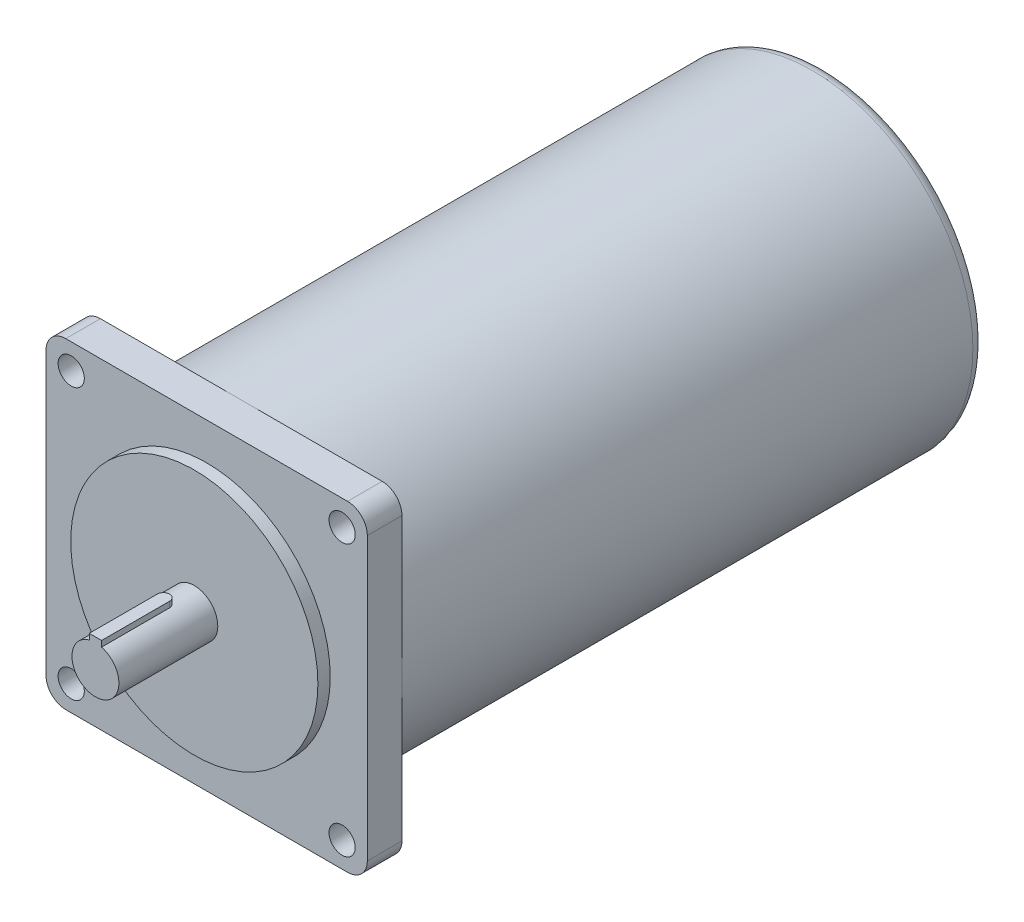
ISO-10303-21;
HEADER;
FILE_DESCRIPTION(('STEP AP214'),'2;1');
FILE_NAME('part.step','',(''),(''),'','','');
FILE_SCHEMA(('AUTOMOTIVE_DESIGN { 1 0 10303 214 1 1 1 1 }'));
ENDSEC;
DATA;
#1=APPLICATION_CONTEXT('core data for automotive mechanical design processes');
#2=APPLICATION_PROTOCOL_DEFINITION('international standard','automotive_design',2000,#1);
#3=PRODUCT_CONTEXT('',#1,'mechanical');
#4=PRODUCT('Part','Part','',(#3));
#5=PRODUCT_RELATED_PRODUCT_CATEGORY('part','',(#4));
#6=PRODUCT_DEFINITION_FORMATION('','',#4);
#7=PRODUCT_DEFINITION_CONTEXT('part definition',#1,'design');
#8=PRODUCT_DEFINITION('design','',#6,#7);
#9=PRODUCT_DEFINITION_SHAPE('','',#8);
#10=(LENGTH_UNIT() NAMED_UNIT(*) SI_UNIT(.MILLI.,.METRE.));
#11=(NAMED_UNIT(*) PLANE_ANGLE_UNIT() SI_UNIT($,.RADIAN.));
#12=(NAMED_UNIT(*) SI_UNIT($,.STERADIAN.) SOLID_ANGLE_UNIT());
#13=UNCERTAINTY_MEASURE_WITH_UNIT(LENGTH_MEASURE(1.E-05),#10,'distance_accuracy_value','');
#14=(GEOMETRIC_REPRESENTATION_CONTEXT(3) GLOBAL_UNCERTAINTY_ASSIGNED_CONTEXT((#13)) GLOBAL_UNIT_ASSIGNED_CONTEXT((#10,
#11,#12)) REPRESENTATION_CONTEXT('',''));
#15=CARTESIAN_POINT('',(0.,0.,0.));
#16=DIRECTION('',(0.,0.,1.));
#17=DIRECTION('',(1.,0.,0.));
#18=AXIS2_PLACEMENT_3D('',#15,#16,#17);
#19=CARTESIAN_POINT('',(57.,-57.,-19.));
#20=DIRECTION('',(0.,0.,1.));
#21=DIRECTION('',(1.,0.,0.));
#22=AXIS2_PLACEMENT_3D('',#19,#20,#21);
#23=PLANE('',#22);
#24=CARTESIAN_POINT('',(-54.8,54.8,-19.));
#25=DIRECTION('',(0.,0.,-1.));
#26=DIRECTION('',(-1.,0.,0.));
#27=AXIS2_PLACEMENT_3D('',#24,#25,#26);
#28=CIRCLE('',#27,5.3);
#29=CARTESIAN_POINT('',(-60.1,54.8,-19.));
#30=VERTEX_POINT('',#29);
#31=EDGE_CURVE('E184',#30,#30,#28,.T.);
#32=ORIENTED_EDGE('',*,*,#31,.F.);
#33=EDGE_LOOP('',(#32));
#34=FACE_BOUND('',#33,.T.);
#35=CARTESIAN_POINT('',(0.,0.,-19.));
#36=DIRECTION('',(0.,0.,-1.));
#37=DIRECTION('',(-1.,0.,0.));
#38=AXIS2_PLACEMENT_3D('',#35,#36,#37);
#39=CIRCLE('',#38,65.);
#40=CARTESIAN_POINT('',(-65.,0.,-19.));
#41=VERTEX_POINT('',#40);
#42=CARTESIAN_POINT('',(0.,65.,-19.));
#43=VERTEX_POINT('',#42);
#44=EDGE_CURVE('E160',#41,#43,#39,.T.);
#45=ORIENTED_EDGE('',*,*,#44,.F.);
#46=DIRECTION('',(0.,1.,0.));
#47=VECTOR('',#46,1.);
#48=CARTESIAN_POINT('',(-65.,56.9999999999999,-19.));
#49=LINE('',#48,#47);
#50=CARTESIAN_POINT('',(-65.,56.9999999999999,-19.));
#51=VERTEX_POINT('',#50);
#52=EDGE_CURVE('E149',#41,#51,#49,.T.);
#53=ORIENTED_EDGE('',*,*,#52,.T.);
#54=CARTESIAN_POINT('',(-57.,57.,-19.));
#55=DIRECTION('',(0.,0.,-1.));
#56=DIRECTION('',(1.,0.,0.));
#57=AXIS2_PLACEMENT_3D('',#54,#55,#56);
#58=CIRCLE('',#57,8.);
#59=CARTESIAN_POINT('',(-56.9999999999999,65.,-19.));
#60=VERTEX_POINT('',#59);
#61=EDGE_CURVE('E148',#51,#60,#58,.T.);
#62=ORIENTED_EDGE('',*,*,#61,.T.);
#63=DIRECTION('',(1.,0.,0.));
#64=VECTOR('',#63,1.);
#65=CARTESIAN_POINT('',(0.,65.,-19.));
#66=LINE('',#65,#64);
#67=EDGE_CURVE('E162',#60,#43,#66,.T.);
#68=ORIENTED_EDGE('',*,*,#67,.T.);
#69=EDGE_LOOP('',(#45,#53,#62,#68));
#70=FACE_BOUND('',#69,.T.);
#71=ADVANCED_FACE('F35',(#34,#70),#23,.F.);
#72=CARTESIAN_POINT('',(54.8,54.8,-19.));
#73=DIRECTION('',(0.,0.,-1.));
#74=DIRECTION('',(-1.,0.,0.));
#75=AXIS2_PLACEMENT_3D('',#72,#73,#74);
#76=CIRCLE('',#75,5.3);
#77=CARTESIAN_POINT('',(49.5,54.8,-19.));
#78=VERTEX_POINT('',#77);
#79=EDGE_CURVE('E190',#78,#78,#76,.T.);
#80=ORIENTED_EDGE('',*,*,#79,.F.);
#81=EDGE_LOOP('',(#80));
#82=FACE_BOUND('',#81,.T.);
#83=CARTESIAN_POINT('',(65.,0.,-19.));
#84=VERTEX_POINT('',#83);
#85=EDGE_CURVE('E58',#43,#84,#39,.T.);
#86=ORIENTED_EDGE('',*,*,#85,.F.);
#87=CARTESIAN_POINT('',(56.9999999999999,65.,-19.));
#88=VERTEX_POINT('',#87);
#89=EDGE_CURVE('E205',#43,#88,#66,.T.);
#90=ORIENTED_EDGE('',*,*,#89,.T.);
#91=CARTESIAN_POINT('',(57.,57.,-19.));
#92=DIRECTION('',(0.,0.,-1.));
#93=DIRECTION('',(1.,0.,0.));
#94=AXIS2_PLACEMENT_3D('',#91,#92,#93);
#95=CIRCLE('',#94,8.);
#96=CARTESIAN_POINT('',(65.,56.9999999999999,-19.));
#97=VERTEX_POINT('',#96);
#98=EDGE_CURVE('E207',#88,#97,#95,.T.);
#99=ORIENTED_EDGE('',*,*,#98,.T.);
#100=DIRECTION('',(0.,-1.,0.));
#101=VECTOR('',#100,1.);
#102=CARTESIAN_POINT('',(65.,-57.,-19.));
#103=LINE('',#102,#101);
#104=EDGE_CURVE('E210',#97,#84,#103,.T.);
#105=ORIENTED_EDGE('',*,*,#104,.T.);
#106=EDGE_LOOP('',(#86,#90,#99,#105));
#107=FACE_BOUND('',#106,.T.);
#108=ADVANCED_FACE('F311',(#82,#107),#23,.F.);
#109=CARTESIAN_POINT('',(54.8,-54.8,-19.));
#110=DIRECTION('',(0.,0.,-1.));
#111=DIRECTION('',(-1.,0.,0.));
#112=AXIS2_PLACEMENT_3D('',#109,#110,#111);
#113=CIRCLE('',#112,5.3);
#114=CARTESIAN_POINT('',(49.5,-54.8,-19.));
#115=VERTEX_POINT('',#114);
#116=EDGE_CURVE('E172',#115,#115,#113,.T.);
#117=ORIENTED_EDGE('',*,*,#116,.F.);
#118=EDGE_LOOP('',(#117));
#119=FACE_BOUND('',#118,.T.);
#120=CARTESIAN_POINT('',(0.,-65.,-19.));
#121=VERTEX_POINT('',#120);
#122=EDGE_CURVE('E50',#84,#121,#39,.T.);
#123=ORIENTED_EDGE('',*,*,#122,.F.);
#124=CARTESIAN_POINT('',(65.,-57.,-19.));
#125=VERTEX_POINT('',#124);
#126=EDGE_CURVE('E209',#84,#125,#103,.T.);
#127=ORIENTED_EDGE('',*,*,#126,.T.);
#128=CARTESIAN_POINT('',(57.,-57.,-19.));
#129=DIRECTION('',(0.,0.,-1.));
#130=DIRECTION('',(1.,0.,0.));
#131=AXIS2_PLACEMENT_3D('',#128,#129,#130);
#132=CIRCLE('',#131,8.);
#133=CARTESIAN_POINT('',(56.9999999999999,-65.,-19.));
#134=VERTEX_POINT('',#133);
#135=EDGE_CURVE('E196',#125,#134,#132,.T.);
#136=ORIENTED_EDGE('',*,*,#135,.T.);
#137=DIRECTION('',(-1.,0.,0.));
#138=VECTOR('',#137,1.);
#139=CARTESIAN_POINT('',(-57.,-65.,-19.));
#140=LINE('',#139,#138);
#141=EDGE_CURVE('E201',#134,#121,#140,.T.);
#142=ORIENTED_EDGE('',*,*,#141,.T.);
#143=EDGE_LOOP('',(#123,#127,#136,#142));
#144=FACE_BOUND('',#143,.T.);
#145=ADVANCED_FACE('F317',(#119,#144),#23,.F.);
#146=CARTESIAN_POINT('',(-54.8,-54.8,-19.));
#147=DIRECTION('',(0.,0.,-1.));
#148=DIRECTION('',(-1.,0.,0.));
#149=AXIS2_PLACEMENT_3D('',#146,#147,#148);
#150=CIRCLE('',#149,5.3);
#151=CARTESIAN_POINT('',(-60.1,-54.8,-19.));
#152=VERTEX_POINT('',#151);
#153=EDGE_CURVE('E178',#152,#152,#150,.T.);
#154=ORIENTED_EDGE('',*,*,#153,.F.);
#155=EDGE_LOOP('',(#154));
#156=FACE_BOUND('',#155,.T.);
#157=EDGE_CURVE('E141',#121,#41,#39,.T.);
#158=ORIENTED_EDGE('',*,*,#157,.F.);
#159=CARTESIAN_POINT('',(-57.,-65.,-19.));
#160=VERTEX_POINT('',#159);
#161=EDGE_CURVE('E199',#121,#160,#140,.T.);
#162=ORIENTED_EDGE('',*,*,#161,.T.);
#163=CARTESIAN_POINT('',(-57.,-57.,-19.));
#164=DIRECTION('',(0.,0.,-1.));
#165=DIRECTION('',(1.,0.,0.));
#166=AXIS2_PLACEMENT_3D('',#163,#164,#165);
#167=CIRCLE('',#166,8.);
#168=CARTESIAN_POINT('',(-65.,-56.9999999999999,-19.));
#169=VERTEX_POINT('',#168);
#170=EDGE_CURVE('E144',#160,#169,#167,.T.);
#171=ORIENTED_EDGE('',*,*,#170,.T.);
#172=EDGE_CURVE('E137',#169,#41,#49,.T.);
#173=ORIENTED_EDGE('',*,*,#172,.T.);
#174=EDGE_LOOP('',(#158,#162,#171,#173));
#175=FACE_BOUND('',#174,.T.);
#176=ADVANCED_FACE('F139',(#156,#175),#23,.F.);
#177=CARTESIAN_POINT('',(0.,0.,40.));
#178=DIRECTION('',(0.,0.,-1.));
#179=DIRECTION('',(-1.,0.,0.));
#180=AXIS2_PLACEMENT_3D('',#177,#178,#179);
#181=CYLINDRICAL_SURFACE('',#180,9.5);
#182=CARTESIAN_POINT('',(0.,0.,0.));
#183=DIRECTION('',(0.,0.,1.));
#184=DIRECTION('',(1.,0.,0.));
#185=AXIS2_PLACEMENT_3D('',#182,#183,#184);
#186=CIRCLE('',#185,9.5);
#187=CARTESIAN_POINT('',(9.5,0.,0.));
#188=VERTEX_POINT('',#187);
#189=EDGE_CURVE('E279',#188,#188,#186,.T.);
#190=ORIENTED_EDGE('',*,*,#189,.T.);
#191=EDGE_LOOP('',(#190));
#192=FACE_BOUND('',#191,.T.);
#193=DIRECTION('',(0.,0.,-1.));
#194=VECTOR('',#193,1.);
#195=CARTESIAN_POINT('',(-2.5,9.16515138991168,40.));
#196=LINE('',#195,#194);
#197=CARTESIAN_POINT('',(-2.5,9.16515138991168,12.5));
#198=VERTEX_POINT('',#197);
#199=CARTESIAN_POINT('',(-2.5,9.16515138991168,40.));
#200=VERTEX_POINT('',#199);
#201=EDGE_CURVE('E276',#198,#200,#196,.F.);
#202=ORIENTED_EDGE('',*,*,#201,.F.);
#203=CARTESIAN_POINT('',(0.,9.5,10.));
#204=CARTESIAN_POINT('',(-0.137884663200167,9.4999978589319,10.0000034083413));
#205=CARTESIAN_POINT('',(-0.275806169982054,9.49696845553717,10.0114455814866));
#206=CARTESIAN_POINT('',(-0.547680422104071,9.48517762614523,10.0568336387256));
#207=CARTESIAN_POINT('',(-0.681631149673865,9.47641333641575,10.0907907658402));
#208=CARTESIAN_POINT('',(-0.941599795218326,9.45412076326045,10.1800315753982));
#209=CARTESIAN_POINT('',(-1.06762755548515,9.44059853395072,10.2352881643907));
#210=CARTESIAN_POINT('',(-1.30862652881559,9.41022151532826,10.3654600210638));
#211=CARTESIAN_POINT('',(-1.42359708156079,9.39336652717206,10.4403764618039));
#212=CARTESIAN_POINT('',(-1.64181993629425,9.35771941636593,10.6095316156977));
#213=CARTESIAN_POINT('',(-1.74478634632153,9.33889486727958,10.7041323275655));
#214=CARTESIAN_POINT('',(-1.93359084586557,9.30164002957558,10.9091965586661));
#215=CARTESIAN_POINT('',(-2.01942679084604,9.28320979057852,11.0196620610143));
#216=CARTESIAN_POINT('',(-2.17291708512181,9.24849966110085,11.2555887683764));
#217=CARTESIAN_POINT('',(-2.24024449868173,9.23226073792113,11.3812692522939));
#218=CARTESIAN_POINT('',(-2.35270147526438,9.20424780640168,11.6426621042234));
#219=CARTESIAN_POINT('',(-2.39783501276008,9.19247299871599,11.7783726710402));
#220=CARTESIAN_POINT('',(-2.46363395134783,9.17505594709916,12.0528119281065));
#221=CARTESIAN_POINT('',(-2.48481677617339,9.16928424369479,12.1914081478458));
#222=CARTESIAN_POINT('',(-2.50372582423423,9.16413995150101,12.470298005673));
#223=CARTESIAN_POINT('',(-2.50145630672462,9.16476620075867,12.6105913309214));
#224=CARTESIAN_POINT('',(-2.47393631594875,9.1722310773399,12.8848702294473));
#225=CARTESIAN_POINT('',(-2.44930986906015,9.1789010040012,13.0189237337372));
#226=CARTESIAN_POINT('',(-2.37877367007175,9.19743185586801,13.2809260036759));
#227=CARTESIAN_POINT('',(-2.33286225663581,9.2092931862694,13.4088742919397));
#228=CARTESIAN_POINT('',(-2.22054589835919,9.23702010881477,13.6566707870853));
#229=CARTESIAN_POINT('',(-2.1539205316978,9.25292841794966,13.7764141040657));
#230=CARTESIAN_POINT('',(-2.00222137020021,9.28693362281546,14.0032413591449));
#231=CARTESIAN_POINT('',(-1.91714402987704,9.30503093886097,14.1103228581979));
#232=CARTESIAN_POINT('',(-1.72775627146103,9.3420790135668,14.3123544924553));
#233=CARTESIAN_POINT('',(-1.62292126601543,9.36103863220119,14.4068119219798));
#234=CARTESIAN_POINT('',(-1.3986680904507,9.39715951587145,14.5769046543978));
#235=CARTESIAN_POINT('',(-1.27924937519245,9.41432071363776,14.6525392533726));
#236=CARTESIAN_POINT('',(-1.02846858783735,9.44501219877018,14.7830484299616));
#237=CARTESIAN_POINT('',(-0.897059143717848,9.45852716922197,14.8378358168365));
#238=CARTESIAN_POINT('',(-0.626458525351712,9.48029259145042,14.924400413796));
#239=CARTESIAN_POINT('',(-0.487269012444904,9.48854416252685,14.9561825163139));
#240=CARTESIAN_POINT('',(-0.209265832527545,9.49868456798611,14.9950653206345));
#241=CARTESIAN_POINT('',(-0.070552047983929,9.50074610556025,15.0028361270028));
#242=CARTESIAN_POINT('',(0.206196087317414,9.49876969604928,14.9953236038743));
#243=CARTESIAN_POINT('',(0.344230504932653,9.49473236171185,14.9800425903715));
#244=CARTESIAN_POINT('',(0.613323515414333,9.48112321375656,14.9274104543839));
#245=CARTESIAN_POINT('',(0.744460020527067,9.47164474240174,14.8904313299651));
#246=CARTESIAN_POINT('',(0.998656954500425,9.44822690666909,14.7958831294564));
#247=CARTESIAN_POINT('',(1.12171651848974,9.43428706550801,14.7383118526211));
#248=CARTESIAN_POINT('',(1.35888360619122,9.40308612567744,14.6029586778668));
#249=CARTESIAN_POINT('',(1.47277384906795,9.38576639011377,14.5248099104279));
#250=CARTESIAN_POINT('',(1.68605972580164,9.34980860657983,14.3509829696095));
#251=CARTESIAN_POINT('',(1.78545256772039,9.33117030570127,14.2553014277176));
#252=CARTESIAN_POINT('',(1.96973268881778,9.29404354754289,14.0460009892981));
#253=CARTESIAN_POINT('',(2.05414772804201,9.27557319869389,13.9319623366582));
#254=CARTESIAN_POINT('',(2.20265077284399,9.24143699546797,13.690949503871));
#255=CARTESIAN_POINT('',(2.26673964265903,9.22577102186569,13.5639758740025));
#256=CARTESIAN_POINT('',(2.37228864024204,9.1991961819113,13.3013437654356));
#257=CARTESIAN_POINT('',(2.41388084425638,9.18825962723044,13.165741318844));
#258=CARTESIAN_POINT('',(2.47357685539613,9.17237100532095,12.8891317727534));
#259=CARTESIAN_POINT('',(2.49168647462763,9.16741745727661,12.7481260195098));
#260=CARTESIAN_POINT('',(2.5035754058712,9.16417710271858,12.4695408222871));
#261=CARTESIAN_POINT('',(2.49811278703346,9.16568256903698,12.3319956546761));
#262=CARTESIAN_POINT('',(2.46476570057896,9.17470557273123,12.0598619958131));
#263=CARTESIAN_POINT('',(2.43688178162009,9.18222296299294,11.9252734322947));
#264=CARTESIAN_POINT('',(2.35991776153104,9.20230081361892,11.6637995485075));
#265=CARTESIAN_POINT('',(2.31099432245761,9.21482395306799,11.5368650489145));
#266=CARTESIAN_POINT('',(2.19346205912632,9.2435040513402,11.2929108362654));
#267=CARTESIAN_POINT('',(2.12485022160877,9.25966156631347,11.1758926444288));
#268=CARTESIAN_POINT('',(1.96757430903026,9.29436941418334,10.9514645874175));
#269=CARTESIAN_POINT('',(1.87839103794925,9.31297513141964,10.8444270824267));
#270=CARTESIAN_POINT('',(1.68349652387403,9.35016921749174,10.6465905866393));
#271=CARTESIAN_POINT('',(1.57778128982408,9.36875758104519,10.5557955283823));
#272=CARTESIAN_POINT('',(1.35018708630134,9.40428175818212,10.3911797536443));
#273=CARTESIAN_POINT('',(1.22801920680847,9.42117547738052,10.3177486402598));
#274=CARTESIAN_POINT('',(0.972633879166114,9.45095016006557,10.1925825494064));
#275=CARTESIAN_POINT('',(0.839423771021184,9.46383376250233,10.1408332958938));
#276=CARTESIAN_POINT('',(0.588875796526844,9.48241870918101,10.0674519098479));
#277=CARTESIAN_POINT('',(0.472643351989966,9.4889642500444,10.0422152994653));
#278=CARTESIAN_POINT('',(0.237616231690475,9.49775561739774,10.0084886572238));
#279=CARTESIAN_POINT('',(0.118821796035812,9.50000184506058,9.99999706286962));
#280=CARTESIAN_POINT('',(0.,9.5,10.));
#281=B_SPLINE_CURVE_WITH_KNOTS('',3,(#203,#204,#205,#206,#207,#208,#209,#210,#211,#212,#213,
#214,#215,#216,#217,#218,#219,#220,#221,#222,#223,#224,#225,#226,#227,#228,#229,#230,#231,#232,
#233,#234,#235,#236,#237,#238,#239,#240,#241,#242,#243,#244,#245,#246,#247,#248,#249,#250,#251,
#252,#253,#254,#255,#256,#257,#258,#259,#260,#261,#262,#263,#264,#265,#266,#267,#268,#269,#270,
#271,#272,#273,#274,#275,#276,#277,#278,#279,#280),.UNSPECIFIED.,.T.,.F.,(4,2,2,2,2,2,2,2,2,2,2,
2,2,2,2,2,2,2,2,2,2,2,2,2,2,2,2,2,2,2,2,2,2,2,2,2,2,2,4),(0.,0.41321830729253,0.826643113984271,
1.23954376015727,1.65246904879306,2.07379267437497,2.49516901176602,2.92356960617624,
3.35189345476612,3.77077570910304,4.18958189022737,4.59704611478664,5.00454214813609,
5.41653210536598,5.82860129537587,6.25374475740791,6.67890411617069,7.10582259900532,
7.53265026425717,7.9474532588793,8.36221458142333,8.77006471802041,9.17795845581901,
9.59368485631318,10.0094912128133,10.4366941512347,10.8638789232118,11.2885277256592,
11.7130714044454,12.1240655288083,12.5350495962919,12.9430250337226,13.3510629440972,
13.7708169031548,14.1906723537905,14.6192052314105,15.0474555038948,15.4035786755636,
15.7596686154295),.UNSPECIFIED.);
#282=CARTESIAN_POINT('',(2.5,9.16515138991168,12.5));
#283=VERTEX_POINT('',#282);
#284=EDGE_CURVE('E167',#283,#198,#281,.T.);
#285=ORIENTED_EDGE('',*,*,#284,.F.);
#286=DIRECTION('',(0.,0.,-1.));
#287=VECTOR('',#286,1.);
#288=CARTESIAN_POINT('',(2.5,9.16515138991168,40.));
#289=LINE('',#288,#287);
#290=CARTESIAN_POINT('',(2.5,9.16515138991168,40.));
#291=VERTEX_POINT('',#290);
#292=EDGE_CURVE('E273',#291,#283,#289,.T.);
#293=ORIENTED_EDGE('',*,*,#292,.F.);
#294=CARTESIAN_POINT('',(0.,0.,40.));
#295=DIRECTION('',(0.,0.,1.));
#296=DIRECTION('',(1.,0.,0.));
#297=AXIS2_PLACEMENT_3D('',#294,#295,#296);
#298=CIRCLE('',#297,9.5);
#299=EDGE_CURVE('E280',#200,#291,#298,.T.);
#300=ORIENTED_EDGE('',*,*,#299,.F.);
#301=EDGE_LOOP('',(#202,#285,#293,#300));
#302=FACE_BOUND('',#301,.T.);
#303=ADVANCED_FACE('F290',(#192,#302),#181,.T.);
#304=CARTESIAN_POINT('',(0.,0.,0.));
#305=DIRECTION('',(0.,0.,1.));
#306=DIRECTION('',(1.,0.,0.));
#307=AXIS2_PLACEMENT_3D('',#304,#305,#306);
#308=PLANE('',#307);
#309=CARTESIAN_POINT('',(0.,0.,0.));
#310=DIRECTION('',(0.,0.,1.));
#311=DIRECTION('',(1.,0.,0.));
#312=AXIS2_PLACEMENT_3D('',#309,#310,#311);
#313=CIRCLE('',#312,50.);
#314=CARTESIAN_POINT('',(50.,0.,0.));
#315=VERTEX_POINT('',#314);
#316=EDGE_CURVE('E169',#315,#315,#313,.T.);
#317=ORIENTED_EDGE('',*,*,#316,.T.);
#318=EDGE_LOOP('',(#317));
#319=FACE_BOUND('',#318,.T.);
#320=ORIENTED_EDGE('',*,*,#189,.F.);
#321=EDGE_LOOP('',(#320));
#322=FACE_BOUND('',#321,.T.);
#323=ADVANCED_FACE('F308',(#319,#322),#308,.T.);
#324=CARTESIAN_POINT('',(0.,0.,-5.));
#325=DIRECTION('',(0.,0.,1.));
#326=DIRECTION('',(1.,0.,0.));
#327=AXIS2_PLACEMENT_3D('',#324,#325,#326);
#328=CYLINDRICAL_SURFACE('',#327,50.);
#329=CARTESIAN_POINT('',(0.,0.,-5.));
#330=DIRECTION('',(0.,0.,1.));
#331=DIRECTION('',(1.,0.,0.));
#332=AXIS2_PLACEMENT_3D('',#329,#330,#331);
#333=CIRCLE('',#332,50.);
#334=CARTESIAN_POINT('',(50.,0.,-5.));
#335=VERTEX_POINT('',#334);
#336=EDGE_CURVE('E249',#335,#335,#333,.F.);
#337=ORIENTED_EDGE('',*,*,#336,.F.);
#338=EDGE_LOOP('',(#337));
#339=FACE_BOUND('',#338,.T.);
#340=ORIENTED_EDGE('',*,*,#316,.F.);
#341=EDGE_LOOP('',(#340));
#342=FACE_BOUND('',#341,.T.);
#343=ADVANCED_FACE('F303',(#339,#342),#328,.T.);
#344=CARTESIAN_POINT('',(0.,0.,40.));
#345=DIRECTION('',(0.,0.,1.));
#346=DIRECTION('',(1.,0.,0.));
#347=AXIS2_PLACEMENT_3D('',#344,#345,#346);
#348=PLANE('',#347);
#349=ORIENTED_EDGE('',*,*,#299,.T.);
#350=DIRECTION('',(0.,-1.,0.));
#351=VECTOR('',#350,1.);
#352=CARTESIAN_POINT('',(2.5,11.5,40.));
#353=LINE('',#352,#351);
#354=CARTESIAN_POINT('',(2.5,11.5,40.));
#355=VERTEX_POINT('',#354);
#356=EDGE_CURVE('E264',#355,#291,#353,.T.);
#357=ORIENTED_EDGE('',*,*,#356,.F.);
#358=DIRECTION('',(1.,0.,0.));
#359=VECTOR('',#358,1.);
#360=CARTESIAN_POINT('',(-2.5,11.5,40.));
#361=LINE('',#360,#359);
#362=CARTESIAN_POINT('',(-2.5,11.5,40.));
#363=VERTEX_POINT('',#362);
#364=EDGE_CURVE('E257',#363,#355,#361,.T.);
#365=ORIENTED_EDGE('',*,*,#364,.F.);
#366=DIRECTION('',(0.,-1.,0.));
#367=VECTOR('',#366,1.);
#368=CARTESIAN_POINT('',(-2.5,11.5,40.));
#369=LINE('',#368,#367);
#370=EDGE_CURVE('E267',#363,#200,#369,.T.);
#371=ORIENTED_EDGE('',*,*,#370,.T.);
#372=EDGE_LOOP('',(#349,#357,#365,#371));
#373=FACE_BOUND('',#372,.T.);
#374=ADVANCED_FACE('F299',(#373),#348,.T.);
#375=CARTESIAN_POINT('',(0.,11.5,12.5));
#376=DIRECTION('',(0.,-1.,0.));
#377=DIRECTION('',(0.,0.,-1.));
#378=AXIS2_PLACEMENT_3D('',#375,#376,#377);
#379=CYLINDRICAL_SURFACE('',#378,2.5);
#380=DIRECTION('',(0.,-1.,0.));
#381=VECTOR('',#380,1.);
#382=CARTESIAN_POINT('',(2.5,11.5,12.5));
#383=LINE('',#382,#381);
#384=CARTESIAN_POINT('',(2.5,11.5,12.5));
#385=VERTEX_POINT('',#384);
#386=EDGE_CURVE('E261',#385,#283,#383,.T.);
#387=ORIENTED_EDGE('',*,*,#386,.T.);
#388=ORIENTED_EDGE('',*,*,#284,.T.);
#389=DIRECTION('',(0.,-1.,0.));
#390=VECTOR('',#389,1.);
#391=CARTESIAN_POINT('',(-2.5,11.5,12.5));
#392=LINE('',#391,#390);
#393=CARTESIAN_POINT('',(-2.5,11.5,12.5));
#394=VERTEX_POINT('',#393);
#395=EDGE_CURVE('E270',#394,#198,#392,.T.);
#396=ORIENTED_EDGE('',*,*,#395,.F.);
#397=CARTESIAN_POINT('',(0.,11.5,12.5));
#398=DIRECTION('',(0.,1.,0.));
#399=DIRECTION('',(0.,0.,1.));
#400=AXIS2_PLACEMENT_3D('',#397,#398,#399);
#401=CIRCLE('',#400,2.5);
#402=EDGE_CURVE('E252',#385,#394,#401,.T.);
#403=ORIENTED_EDGE('',*,*,#402,.F.);
#404=EDGE_LOOP('',(#387,#388,#396,#403));
#405=FACE_BOUND('',#404,.T.);
#406=ADVANCED_FACE('F294',(#405),#379,.T.);
#407=CARTESIAN_POINT('',(-2.5,11.5,12.5));
#408=DIRECTION('',(1.,0.,0.));
#409=DIRECTION('',(0.,0.,-1.));
#410=AXIS2_PLACEMENT_3D('',#407,#408,#409);
#411=PLANE('',#410);
#412=ORIENTED_EDGE('',*,*,#395,.T.);
#413=ORIENTED_EDGE('',*,*,#201,.T.);
#414=ORIENTED_EDGE('',*,*,#370,.F.);
#415=DIRECTION('',(0.,0.,1.));
#416=VECTOR('',#415,1.);
#417=CARTESIAN_POINT('',(-2.5,11.5,12.5));
#418=LINE('',#417,#416);
#419=EDGE_CURVE('E255',#394,#363,#418,.T.);
#420=ORIENTED_EDGE('',*,*,#419,.F.);
#421=EDGE_LOOP('',(#412,#413,#414,#420));
#422=FACE_BOUND('',#421,.T.);
#423=ADVANCED_FACE('F298',(#422),#411,.F.);
#424=CARTESIAN_POINT('',(2.5,11.5,40.));
#425=DIRECTION('',(-1.,0.,0.));
#426=DIRECTION('',(0.,0.,1.));
#427=AXIS2_PLACEMENT_3D('',#424,#425,#426);
#428=PLANE('',#427);
#429=ORIENTED_EDGE('',*,*,#356,.T.);
#430=ORIENTED_EDGE('',*,*,#292,.T.);
#431=ORIENTED_EDGE('',*,*,#386,.F.);
#432=DIRECTION('',(0.,0.,-1.));
#433=VECTOR('',#432,1.);
#434=CARTESIAN_POINT('',(2.5,11.5,40.));
#435=LINE('',#434,#433);
#436=EDGE_CURVE('E259',#355,#385,#435,.T.);
#437=ORIENTED_EDGE('',*,*,#436,.F.);
#438=EDGE_LOOP('',(#429,#430,#431,#437));
#439=FACE_BOUND('',#438,.T.);
#440=ADVANCED_FACE('F408',(#439),#428,.F.);
#441=CARTESIAN_POINT('',(0.,11.5,12.5));
#442=DIRECTION('',(0.,1.,0.));
#443=DIRECTION('',(0.,0.,1.));
#444=AXIS2_PLACEMENT_3D('',#441,#442,#443);
#445=PLANE('',#444);
#446=ORIENTED_EDGE('',*,*,#402,.T.);
#447=ORIENTED_EDGE('',*,*,#419,.T.);
#448=ORIENTED_EDGE('',*,*,#364,.T.);
#449=ORIENTED_EDGE('',*,*,#436,.T.);
#450=EDGE_LOOP('',(#446,#447,#448,#449));
#451=FACE_BOUND('',#450,.T.);
#452=ADVANCED_FACE('F344',(#451),#445,.T.);
#453=CARTESIAN_POINT('',(57.,-57.,-5.));
#454=DIRECTION('',(0.,0.,1.));
#455=DIRECTION('',(1.,0.,0.));
#456=AXIS2_PLACEMENT_3D('',#453,#454,#455);
#457=PLANE('',#456);
#458=ORIENTED_EDGE('',*,*,#336,.T.);
#459=EDGE_LOOP('',(#458));
#460=FACE_BOUND('',#459,.T.);
#461=CARTESIAN_POINT('',(-54.8,-54.8,-5.));
#462=DIRECTION('',(0.,0.,-1.));
#463=DIRECTION('',(-1.,0.,0.));
#464=AXIS2_PLACEMENT_3D('',#461,#462,#463);
#465=CIRCLE('',#464,5.3);
#466=CARTESIAN_POINT('',(-60.1,-54.8,-5.));
#467=VERTEX_POINT('',#466);
#468=EDGE_CURVE('E175',#467,#467,#465,.T.);
#469=ORIENTED_EDGE('',*,*,#468,.T.);
#470=EDGE_LOOP('',(#469));
#471=FACE_BOUND('',#470,.T.);
#472=CARTESIAN_POINT('',(54.8,54.8,-5.));
#473=DIRECTION('',(0.,0.,-1.));
#474=DIRECTION('',(-1.,0.,0.));
#475=AXIS2_PLACEMENT_3D('',#472,#473,#474);
#476=CIRCLE('',#475,5.3);
#477=CARTESIAN_POINT('',(49.5,54.8,-5.));
#478=VERTEX_POINT('',#477);
#479=EDGE_CURVE('E187',#478,#478,#476,.T.);
#480=ORIENTED_EDGE('',*,*,#479,.T.);
#481=EDGE_LOOP('',(#480));
#482=FACE_BOUND('',#481,.T.);
#483=CARTESIAN_POINT('',(57.,-57.,-5.));
#484=DIRECTION('',(0.,0.,-1.));
#485=DIRECTION('',(1.,0.,0.));
#486=AXIS2_PLACEMENT_3D('',#483,#484,#485);
#487=CIRCLE('',#486,8.);
#488=CARTESIAN_POINT('',(65.,-57.,-5.));
#489=VERTEX_POINT('',#488);
#490=CARTESIAN_POINT('',(56.9999999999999,-65.,-5.));
#491=VERTEX_POINT('',#490);
#492=EDGE_CURVE('E193',#489,#491,#487,.T.);
#493=ORIENTED_EDGE('',*,*,#492,.F.);
#494=DIRECTION('',(0.,-1.,0.));
#495=VECTOR('',#494,1.);
#496=CARTESIAN_POINT('',(65.,-57.,-5.));
#497=LINE('',#496,#495);
#498=CARTESIAN_POINT('',(65.,56.9999999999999,-5.));
#499=VERTEX_POINT('',#498);
#500=EDGE_CURVE('E200',#499,#489,#497,.T.);
#501=ORIENTED_EDGE('',*,*,#500,.F.);
#502=CARTESIAN_POINT('',(57.,57.,-5.));
#503=DIRECTION('',(0.,0.,-1.));
#504=DIRECTION('',(1.,0.,0.));
#505=AXIS2_PLACEMENT_3D('',#502,#503,#504);
#506=CIRCLE('',#505,8.);
#507=CARTESIAN_POINT('',(56.9999999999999,65.,-5.));
#508=VERTEX_POINT('',#507);
#509=EDGE_CURVE('E226',#508,#499,#506,.T.);
#510=ORIENTED_EDGE('',*,*,#509,.F.);
#511=DIRECTION('',(1.,0.,0.));
#512=VECTOR('',#511,1.);
#513=CARTESIAN_POINT('',(56.9999999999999,65.,-5.));
#514=LINE('',#513,#512);
#515=CARTESIAN_POINT('',(-56.9999999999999,65.,-5.));
#516=VERTEX_POINT('',#515);
#517=EDGE_CURVE('E224',#516,#508,#514,.T.);
#518=ORIENTED_EDGE('',*,*,#517,.F.);
#519=CARTESIAN_POINT('',(-57.,57.,-5.));
#520=DIRECTION('',(0.,0.,-1.));
#521=DIRECTION('',(1.,0.,0.));
#522=AXIS2_PLACEMENT_3D('',#519,#520,#521);
#523=CIRCLE('',#522,8.);
#524=CARTESIAN_POINT('',(-65.,56.9999999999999,-5.));
#525=VERTEX_POINT('',#524);
#526=EDGE_CURVE('E221',#525,#516,#523,.T.);
#527=ORIENTED_EDGE('',*,*,#526,.F.);
#528=DIRECTION('',(0.,1.,0.));
#529=VECTOR('',#528,1.);
#530=CARTESIAN_POINT('',(-65.,56.9999999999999,-5.));
#531=LINE('',#530,#529);
#532=CARTESIAN_POINT('',(-65.,-56.9999999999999,-5.));
#533=VERTEX_POINT('',#532);
#534=EDGE_CURVE('E219',#533,#525,#531,.T.);
#535=ORIENTED_EDGE('',*,*,#534,.F.);
#536=CARTESIAN_POINT('',(-57.,-57.,-5.));
#537=DIRECTION('',(0.,0.,-1.));
#538=DIRECTION('',(1.,0.,0.));
#539=AXIS2_PLACEMENT_3D('',#536,#537,#538);
#540=CIRCLE('',#539,8.);
#541=CARTESIAN_POINT('',(-57.,-65.,-5.));
#542=VERTEX_POINT('',#541);
#543=EDGE_CURVE('E217',#542,#533,#540,.T.);
#544=ORIENTED_EDGE('',*,*,#543,.F.);
#545=DIRECTION('',(-1.,0.,0.));
#546=VECTOR('',#545,1.);
#547=CARTESIAN_POINT('',(-57.,-65.,-5.));
#548=LINE('',#547,#546);
#549=EDGE_CURVE('E215',#491,#542,#548,.T.);
#550=ORIENTED_EDGE('',*,*,#549,.F.);
#551=EDGE_LOOP('',(#493,#501,#510,#518,#527,#535,#544,#550));
#552=FACE_BOUND('',#551,.T.);
#553=CARTESIAN_POINT('',(-54.8,54.8,-5.));
#554=DIRECTION('',(0.,0.,-1.));
#555=DIRECTION('',(-1.,0.,0.));
#556=AXIS2_PLACEMENT_3D('',#553,#554,#555);
#557=CIRCLE('',#556,5.3);
#558=CARTESIAN_POINT('',(-60.1,54.8,-5.));
#559=VERTEX_POINT('',#558);
#560=EDGE_CURVE('E181',#559,#559,#557,.T.);
#561=ORIENTED_EDGE('',*,*,#560,.T.);
#562=EDGE_LOOP('',(#561));
#563=FACE_BOUND('',#562,.T.);
#564=CARTESIAN_POINT('',(54.8,-54.8,-5.));
#565=DIRECTION('',(0.,0.,-1.));
#566=DIRECTION('',(-1.,0.,0.));
#567=AXIS2_PLACEMENT_3D('',#564,#565,#566);
#568=CIRCLE('',#567,5.3);
#569=CARTESIAN_POINT('',(49.5,-54.8,-5.));
#570=VERTEX_POINT('',#569);
#571=EDGE_CURVE('E164',#570,#570,#568,.T.);
#572=ORIENTED_EDGE('',*,*,#571,.T.);
#573=EDGE_LOOP('',(#572));
#574=FACE_BOUND('',#573,.T.);
#575=ADVANCED_FACE('F340',(#460,#471,#482,#552,#563,#574),#457,.T.);
#576=CARTESIAN_POINT('',(57.,-57.,-19.));
#577=DIRECTION('',(0.,0.,1.));
#578=DIRECTION('',(1.,0.,0.));
#579=AXIS2_PLACEMENT_3D('',#576,#577,#578);
#580=CYLINDRICAL_SURFACE('',#579,8.);
#581=ORIENTED_EDGE('',*,*,#492,.T.);
#582=DIRECTION('',(0.,0.,1.));
#583=VECTOR('',#582,1.);
#584=CARTESIAN_POINT('',(56.9999999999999,-65.,-19.));
#585=LINE('',#584,#583);
#586=EDGE_CURVE('E246',#134,#491,#585,.T.);
#587=ORIENTED_EDGE('',*,*,#586,.F.);
#588=ORIENTED_EDGE('',*,*,#135,.F.);
#589=DIRECTION('',(0.,0.,1.));
#590=VECTOR('',#589,1.);
#591=CARTESIAN_POINT('',(65.,-57.,-19.));
#592=LINE('',#591,#590);
#593=EDGE_CURVE('E212',#125,#489,#592,.T.);
#594=ORIENTED_EDGE('',*,*,#593,.T.);
#595=EDGE_LOOP('',(#581,#587,#588,#594));
#596=FACE_BOUND('',#595,.T.);
#597=ADVANCED_FACE('F343',(#596),#580,.T.);
#598=CARTESIAN_POINT('',(-57.,-65.,-19.));
#599=DIRECTION('',(0.,1.,0.));
#600=DIRECTION('',(-1.,0.,0.));
#601=AXIS2_PLACEMENT_3D('',#598,#599,#600);
#602=PLANE('',#601);
#603=ORIENTED_EDGE('',*,*,#549,.T.);
#604=DIRECTION('',(0.,0.,1.));
#605=VECTOR('',#604,1.);
#606=CARTESIAN_POINT('',(-57.,-65.,-19.));
#607=LINE('',#606,#605);
#608=EDGE_CURVE('E243',#160,#542,#607,.T.);
#609=ORIENTED_EDGE('',*,*,#608,.F.);
#610=ORIENTED_EDGE('',*,*,#161,.F.);
#611=ORIENTED_EDGE('',*,*,#141,.F.);
#612=ORIENTED_EDGE('',*,*,#586,.T.);
#613=EDGE_LOOP('',(#603,#609,#610,#611,#612));
#614=FACE_BOUND('',#613,.T.);
#615=ADVANCED_FACE('F399',(#614),#602,.F.);
#616=CARTESIAN_POINT('',(-57.,-57.,-19.));
#617=DIRECTION('',(0.,0.,1.));
#618=DIRECTION('',(1.,0.,0.));
#619=AXIS2_PLACEMENT_3D('',#616,#617,#618);
#620=CYLINDRICAL_SURFACE('',#619,8.);
#621=ORIENTED_EDGE('',*,*,#543,.T.);
#622=DIRECTION('',(0.,0.,1.));
#623=VECTOR('',#622,1.);
#624=CARTESIAN_POINT('',(-65.,-56.9999999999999,-19.));
#625=LINE('',#624,#623);
#626=EDGE_CURVE('E241',#169,#533,#625,.T.);
#627=ORIENTED_EDGE('',*,*,#626,.F.);
#628=ORIENTED_EDGE('',*,*,#170,.F.);
#629=ORIENTED_EDGE('',*,*,#608,.T.);
#630=EDGE_LOOP('',(#621,#627,#628,#629));
#631=FACE_BOUND('',#630,.T.);
#632=ADVANCED_FACE('F396',(#631),#620,.T.);
#633=CARTESIAN_POINT('',(-65.,56.9999999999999,-19.));
#634=DIRECTION('',(1.,0.,0.));
#635=DIRECTION('',(0.,1.,0.));
#636=AXIS2_PLACEMENT_3D('',#633,#634,#635);
#637=PLANE('',#636);
#638=ORIENTED_EDGE('',*,*,#534,.T.);
#639=DIRECTION('',(0.,0.,1.));
#640=VECTOR('',#639,1.);
#641=CARTESIAN_POINT('',(-65.,56.9999999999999,-19.));
#642=LINE('',#641,#640);
#643=EDGE_CURVE('E155',#51,#525,#642,.T.);
#644=ORIENTED_EDGE('',*,*,#643,.F.);
#645=ORIENTED_EDGE('',*,*,#52,.F.);
#646=ORIENTED_EDGE('',*,*,#172,.F.);
#647=ORIENTED_EDGE('',*,*,#626,.T.);
#648=EDGE_LOOP('',(#638,#644,#645,#646,#647));
#649=FACE_BOUND('',#648,.T.);
#650=ADVANCED_FACE('F153',(#649),#637,.F.);
#651=CARTESIAN_POINT('',(-57.,57.,-19.));
#652=DIRECTION('',(0.,0.,1.));
#653=DIRECTION('',(1.,0.,0.));
#654=AXIS2_PLACEMENT_3D('',#651,#652,#653);
#655=CYLINDRICAL_SURFACE('',#654,8.);
#656=ORIENTED_EDGE('',*,*,#526,.T.);
#657=DIRECTION('',(0.,0.,1.));
#658=VECTOR('',#657,1.);
#659=CARTESIAN_POINT('',(-56.9999999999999,65.,-19.));
#660=LINE('',#659,#658);
#661=EDGE_CURVE('E237',#60,#516,#660,.T.);
#662=ORIENTED_EDGE('',*,*,#661,.F.);
#663=ORIENTED_EDGE('',*,*,#61,.F.);
#664=ORIENTED_EDGE('',*,*,#643,.T.);
#665=EDGE_LOOP('',(#656,#662,#663,#664));
#666=FACE_BOUND('',#665,.T.);
#667=ADVANCED_FACE('F389',(#666),#655,.T.);
#668=CARTESIAN_POINT('',(56.9999999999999,65.,-19.));
#669=DIRECTION('',(0.,-1.,0.));
#670=DIRECTION('',(1.,0.,0.));
#671=AXIS2_PLACEMENT_3D('',#668,#669,#670);
#672=PLANE('',#671);
#673=ORIENTED_EDGE('',*,*,#517,.T.);
#674=DIRECTION('',(0.,0.,1.));
#675=VECTOR('',#674,1.);
#676=CARTESIAN_POINT('',(56.9999999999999,65.,-19.));
#677=LINE('',#676,#675);
#678=EDGE_CURVE('E234',#88,#508,#677,.T.);
#679=ORIENTED_EDGE('',*,*,#678,.F.);
#680=ORIENTED_EDGE('',*,*,#89,.F.);
#681=ORIENTED_EDGE('',*,*,#67,.F.);
#682=ORIENTED_EDGE('',*,*,#661,.T.);
#683=EDGE_LOOP('',(#673,#679,#680,#681,#682));
#684=FACE_BOUND('',#683,.T.);
#685=ADVANCED_FACE('F383',(#684),#672,.F.);
#686=CARTESIAN_POINT('',(57.,57.,-19.));
#687=DIRECTION('',(0.,0.,1.));
#688=DIRECTION('',(1.,0.,0.));
#689=AXIS2_PLACEMENT_3D('',#686,#687,#688);
#690=CYLINDRICAL_SURFACE('',#689,8.);
#691=ORIENTED_EDGE('',*,*,#509,.T.);
#692=DIRECTION('',(0.,0.,1.));
#693=VECTOR('',#692,1.);
#694=CARTESIAN_POINT('',(65.,56.9999999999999,-19.));
#695=LINE('',#694,#693);
#696=EDGE_CURVE('E231',#97,#499,#695,.T.);
#697=ORIENTED_EDGE('',*,*,#696,.F.);
#698=ORIENTED_EDGE('',*,*,#98,.F.);
#699=ORIENTED_EDGE('',*,*,#678,.T.);
#700=EDGE_LOOP('',(#691,#697,#698,#699));
#701=FACE_BOUND('',#700,.T.);
#702=ADVANCED_FACE('F375',(#701),#690,.T.);
#703=CARTESIAN_POINT('',(65.,-57.,-19.));
#704=DIRECTION('',(-1.,0.,0.));
#705=DIRECTION('',(0.,0.,1.));
#706=AXIS2_PLACEMENT_3D('',#703,#704,#705);
#707=PLANE('',#706);
#708=ORIENTED_EDGE('',*,*,#500,.T.);
#709=ORIENTED_EDGE('',*,*,#593,.F.);
#710=ORIENTED_EDGE('',*,*,#126,.F.);
#711=ORIENTED_EDGE('',*,*,#104,.F.);
#712=ORIENTED_EDGE('',*,*,#696,.T.);
#713=EDGE_LOOP('',(#708,#709,#710,#711,#712));
#714=FACE_BOUND('',#713,.T.);
#715=ADVANCED_FACE('F370',(#714),#707,.F.);
#716=CARTESIAN_POINT('',(54.8,54.8,-19.));
#717=DIRECTION('',(0.,0.,1.));
#718=DIRECTION('',(1.,0.,0.));
#719=AXIS2_PLACEMENT_3D('',#716,#717,#718);
#720=CYLINDRICAL_SURFACE('',#719,5.3);
#721=ORIENTED_EDGE('',*,*,#79,.T.);
#722=EDGE_LOOP('',(#721));
#723=FACE_BOUND('',#722,.T.);
#724=ORIENTED_EDGE('',*,*,#479,.F.);
#725=EDGE_LOOP('',(#724));
#726=FACE_BOUND('',#725,.T.);
#727=ADVANCED_FACE('F367',(#723,#726),#720,.F.);
#728=CARTESIAN_POINT('',(-54.8,54.8,-19.));
#729=DIRECTION('',(0.,0.,1.));
#730=DIRECTION('',(1.,0.,0.));
#731=AXIS2_PLACEMENT_3D('',#728,#729,#730);
#732=CYLINDRICAL_SURFACE('',#731,5.3);
#733=ORIENTED_EDGE('',*,*,#31,.T.);
#734=EDGE_LOOP('',(#733));
#735=FACE_BOUND('',#734,.T.);
#736=ORIENTED_EDGE('',*,*,#560,.F.);
#737=EDGE_LOOP('',(#736));
#738=FACE_BOUND('',#737,.T.);
#739=ADVANCED_FACE('F336',(#735,#738),#732,.F.);
#740=CARTESIAN_POINT('',(-54.8,-54.8,-19.));
#741=DIRECTION('',(0.,0.,1.));
#742=DIRECTION('',(1.,0.,0.));
#743=AXIS2_PLACEMENT_3D('',#740,#741,#742);
#744=CYLINDRICAL_SURFACE('',#743,5.3);
#745=ORIENTED_EDGE('',*,*,#153,.T.);
#746=EDGE_LOOP('',(#745));
#747=FACE_BOUND('',#746,.T.);
#748=ORIENTED_EDGE('',*,*,#468,.F.);
#749=EDGE_LOOP('',(#748));
#750=FACE_BOUND('',#749,.T.);
#751=ADVANCED_FACE('F332',(#747,#750),#744,.F.);
#752=CARTESIAN_POINT('',(54.8,-54.8,-19.));
#753=DIRECTION('',(0.,0.,1.));
#754=DIRECTION('',(1.,0.,0.));
#755=AXIS2_PLACEMENT_3D('',#752,#753,#754);
#756=CYLINDRICAL_SURFACE('',#755,5.3);
#757=ORIENTED_EDGE('',*,*,#116,.T.);
#758=EDGE_LOOP('',(#757));
#759=FACE_BOUND('',#758,.T.);
#760=ORIENTED_EDGE('',*,*,#571,.F.);
#761=EDGE_LOOP('',(#760));
#762=FACE_BOUND('',#761,.T.);
#763=ADVANCED_FACE('F335',(#759,#762),#756,.F.);
#764=CARTESIAN_POINT('',(0.,0.,-255.));
#765=DIRECTION('',(0.,0.,1.));
#766=DIRECTION('',(1.,0.,0.));
#767=AXIS2_PLACEMENT_3D('',#764,#765,#766);
#768=CYLINDRICAL_SURFACE('',#767,65.);
#769=CARTESIAN_POINT('',(0.,0.,-250.));
#770=DIRECTION('',(0.,0.,-1.));
#771=DIRECTION('',(-1.,0.,0.));
#772=AXIS2_PLACEMENT_3D('',#769,#770,#771);
#773=CIRCLE('',#772,65.);
#774=CARTESIAN_POINT('',(-65.,0.,-250.));
#775=VERTEX_POINT('',#774);
#776=EDGE_CURVE('E11',#775,#775,#773,.F.);
#777=ORIENTED_EDGE('',*,*,#776,.T.);
#778=EDGE_LOOP('',(#777));
#779=FACE_BOUND('',#778,.T.);
#780=ORIENTED_EDGE('',*,*,#44,.T.);
#781=ORIENTED_EDGE('',*,*,#85,.T.);
#782=ORIENTED_EDGE('',*,*,#122,.T.);
#783=ORIENTED_EDGE('',*,*,#157,.T.);
#784=EDGE_LOOP('',(#780,#781,#782,#783));
#785=FACE_BOUND('',#784,.T.);
#786=ADVANCED_FACE('F166',(#779,#785),#768,.T.);
#787=CARTESIAN_POINT('',(0.,0.,-255.));
#788=DIRECTION('',(0.,0.,-1.));
#789=DIRECTION('',(-1.,0.,0.));
#790=AXIS2_PLACEMENT_3D('',#787,#788,#789);
#791=PLANE('',#790);
#792=CARTESIAN_POINT('',(0.,0.,-255.));
#793=DIRECTION('',(0.,0.,-1.));
#794=DIRECTION('',(-1.,0.,0.));
#795=AXIS2_PLACEMENT_3D('',#792,#793,#794);
#796=CIRCLE('',#795,60.);
#797=CARTESIAN_POINT('',(-60.,0.,-255.));
#798=VERTEX_POINT('',#797);
#799=EDGE_CURVE('E43',#798,#798,#796,.T.);
#800=ORIENTED_EDGE('',*,*,#799,.T.);
#801=EDGE_LOOP('',(#800));
#802=FACE_BOUND('',#801,.T.);
#803=ADVANCED_FACE('F361',(#802),#791,.T.);
#804=CARTESIAN_POINT('',(0.,0.,-250.));
#805=DIRECTION('',(0.,0.,-1.));
#806=DIRECTION('',(-1.,0.,0.));
#807=AXIS2_PLACEMENT_3D('',#804,#805,#806);
#808=TOROIDAL_SURFACE('',#807,60.,5.);
#809=ORIENTED_EDGE('',*,*,#776,.F.);
#810=EDGE_LOOP('',(#809));
#811=FACE_BOUND('',#810,.T.);
#812=ORIENTED_EDGE('',*,*,#799,.F.);
#813=EDGE_LOOP('',(#812));
#814=FACE_BOUND('',#813,.T.);
#815=ADVANCED_FACE('F37',(#811,#814),#808,.T.);
#816=CLOSED_SHELL('',(#71,#108,#145,#176,#303,#323,#343,#374,#406,#423,#440,#452,#575,#597,#615,
#632,#650,#667,#685,#702,#715,#727,#739,#751,#763,#786,#803,#815));
#817=MANIFOLD_SOLID_BREP('B2',#816);
#818=ADVANCED_BREP_SHAPE_REPRESENTATION('',(#18,#817),#14);
#819=SHAPE_DEFINITION_REPRESENTATION(#9,#818);
ENDSEC;
END-ISO-10303-21;
